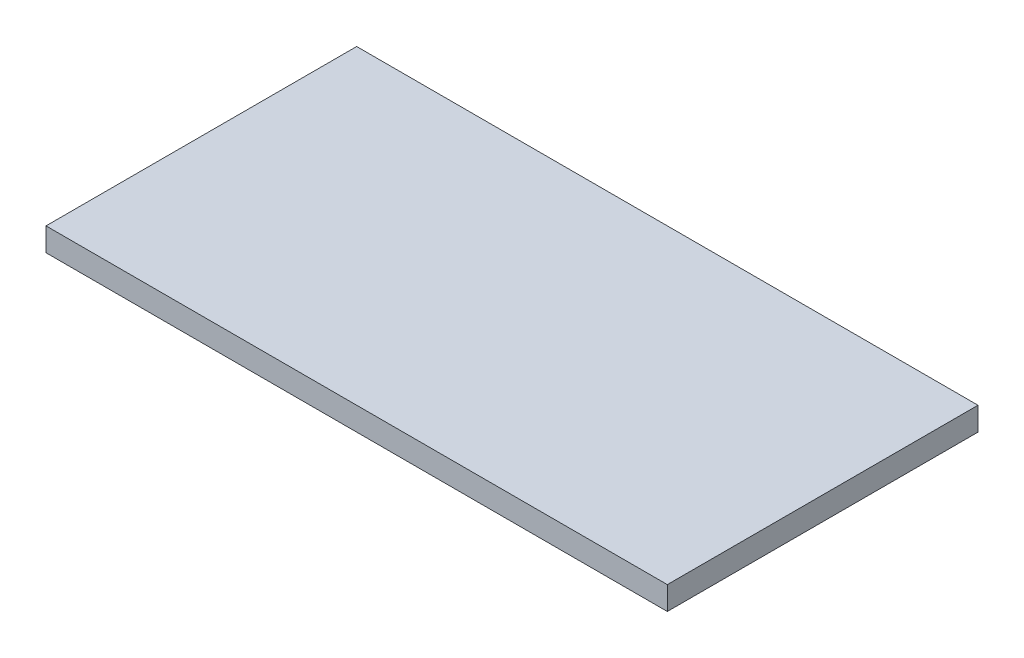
from build123d import *

# Parameters (mm, degrees)
SKETCH1_W           = 127
SKETCH1_H           = 63.5
BOSS_EXTRUDE1_DEPTH = 4.7625


with BuildPart() as part:
    # Sketch1 → Boss-Extrude1 (new body)
    with BuildSketch(Plane(origin=(0, 0, 0), x_dir=(1, 0, 0), z_dir=(0, 1, 0))):
        Rectangle(SKETCH1_W, SKETCH1_H)
    extrude(amount=BOSS_EXTRUDE1_DEPTH)


solid = part.part
